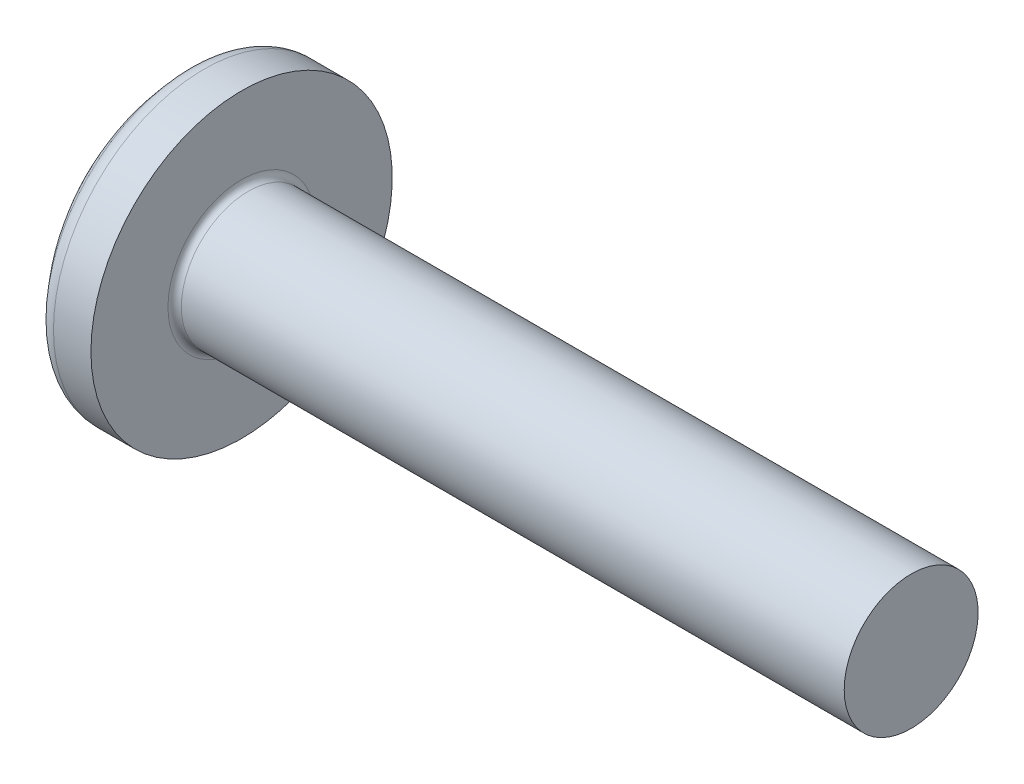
from build123d import *

# Parameters (mm, degrees)
FILLET1_R    = 0.1
RECPAT_COUNT = 2
RECPAT_ANGLE = 90


with BuildPart() as part:
    # BodySke → Base-Revolve (revolve)
    with BuildSketch(Plane.XY, mode=Mode.PRIVATE) as base_revolve_sk:
        with BuildLine():
            Line((1.6, 1), (1.6, 2.25))
            Line((1.6, 2.25), (1.040254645, 2.25))
            ThreePointArc((1.040254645, 2.25), (0.931542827, 2.227147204), (0.841233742, 2.162457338))
            ThreePointArc((0.841233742, 2.162457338), (0.217714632, 1.16016119), (0, 0))
            Line((0, 0), (11.6, 0))
            Line((11.6, 0), (11.6, 1))
            Line((11.6, 1), (1.6, 1))
        make_face()
    revolve(base_revolve_sk.sketch.rotate(Axis((-25.4, 0, 0), (1, 0, 0)), 90), axis=Axis((-25.4, 0, 0), (1, 0, 0)))

    # Fillet1
    fillet1_edges = [part.edges().sort_by_distance(p)[0] for p in [
        (1.6, 0, -1),
    ]]
    fillet(fillet1_edges, radius=FILLET1_R)

    # Sketch3 → Recess section 0
    with BuildSketch(Plane(origin=(0, 0, 0), x_dir=(0, 0, -1), z_dir=(1, 0, 0))):
        with BuildLine():
            Line((0.37, -0.95), (-0.37, -0.95))
            Line((-0.37, -0.95), (-0.37, 0.95))
            Line((-0.37, 0.95), (0.37, 0.95))
            Line((0.37, 0.95), (0.37, -0.95))
        make_face()
    # Sketch4 → Recess section 1
    with BuildSketch(Plane(origin=(1.75, 0, 0), x_dir=(0, 0, -1), z_dir=(1, 0, 0))):
        with BuildLine():
            Line((0.37, -0.527482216), (-0.37, -0.527482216))
            Line((-0.37, -0.527482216), (-0.37, 0.527482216))
            Line((-0.37, 0.527482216), (0.37, 0.527482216))
            Line((0.37, 0.527482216), (0.37, -0.527482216))
        make_face()
    recess = loft(mode=Mode.SUBTRACT)

    # RecPat: Recess ×2 about axis
    recpat_axis = Axis((0, 0, 0), (1, 0, 0))
    for i in range(1, RECPAT_COUNT):
        add(recess.rotate(recpat_axis, i * RECPAT_ANGLE / (RECPAT_COUNT - 1)), mode=Mode.SUBTRACT)

    # RecCorSke → RecessCore (revolve, cut)
    with BuildSketch(Plane.XY, mode=Mode.PRIVATE) as recesscore_sk:
        Polygon((0, 0), (0, 0.678371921), (1.75, 0.556), (1.930655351, 0), align=None)
    revolve(recesscore_sk.sketch.rotate(Axis((-3.175, 0, 0), (1, 0, 0)), 22.071251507), axis=Axis((-3.175, 0, 0), (1, 0, 0)), mode=Mode.SUBTRACT)


solid = part.part
